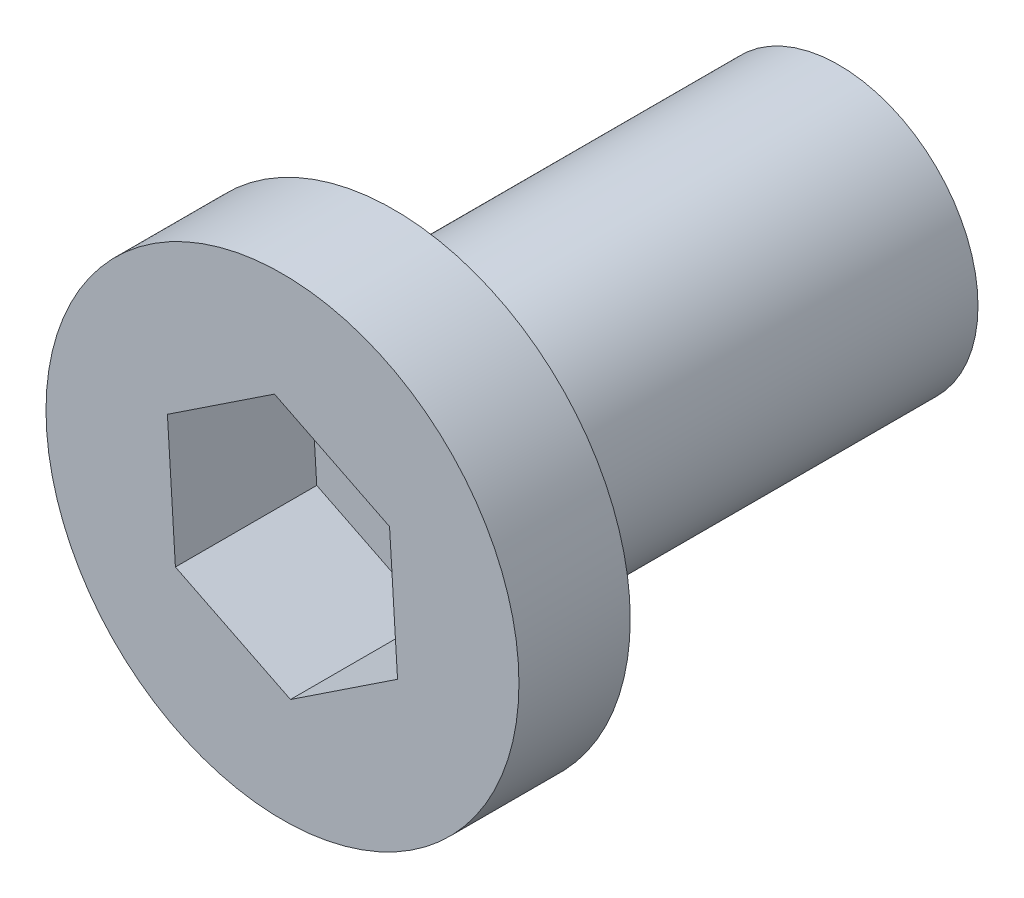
from build123d import *

# Parameters (mm, degrees)
SKETCH1_R           = 2.5
BOSS_EXTRUDE1_DEPTH = 8
SKETCH2_R           = 4.25
BOSS_EXTRUDE2_DEPTH = 2
CUT_EXTRUDE1_DEPTH  = 2.54


with BuildPart() as part:
    # Sketch1 → Boss-Extrude1 (new body)
    with BuildSketch(Plane.XY):
        Circle(SKETCH1_R)
    extrude(amount=BOSS_EXTRUDE1_DEPTH)

    # Sketch2 → Boss-Extrude2 (add)
    with BuildSketch(Plane.XY.offset(8)):
        Circle(SKETCH2_R)
    extrude(amount=BOSS_EXTRUDE2_DEPTH)

    # Sketch3 → Cut-Extrude1 (cut)
    with BuildSketch(Plane.XY.offset(10)):
        Polygon((2.068052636, -1.027857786), (1.924177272, 1.277057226), (-0.143875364, 2.304915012), (-2.068052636, 1.027857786), (-1.924177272, -1.277057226), (0.143875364, -2.304915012), align=None)
    extrude(amount=-CUT_EXTRUDE1_DEPTH, mode=Mode.SUBTRACT)


solid = part.part
